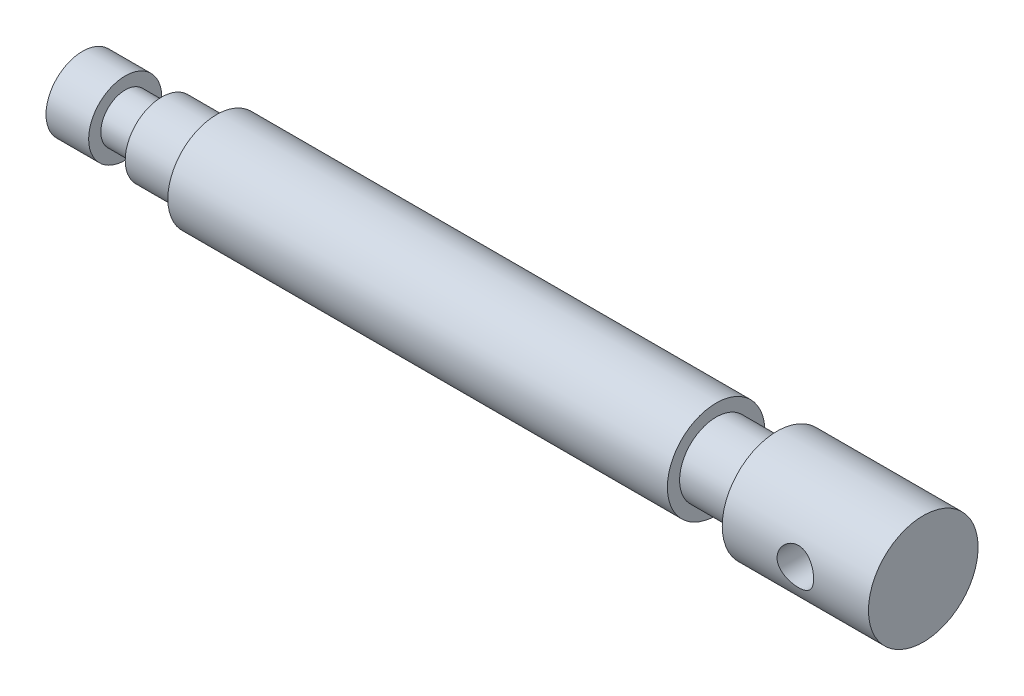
from build123d import *

# Parameters (mm, degrees)
CUT_EXTRUDE1_DEPTH      = 139.585713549
CUT_EXTRUDE1_DEPTH_BACK = 139.585713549
SKETCH2_R               = 3


with BuildPart() as part:
    # Sketch1 → Revolve1 (revolve)
    with BuildSketch(Plane.XY, mode=Mode.PRIVATE) as revolve1_sk:
        Polygon((0, 0), (0, 6), (7, 6), (7, 4), (13, 4), (13, 6), (22, 6), (22, 8), (104, 8), (104, 6), (114, 6), (114, 9), (138, 9), (138, 0), align=None)
    revolve(revolve1_sk.sketch.rotate(Axis((0, 0, 0), (1, 0, 0)), 90), axis=Axis((0, 0, 0), (1, 0, 0)))

    # Sketch2 → Cut-Extrude1 (cut, two sides: drawn at the far end of the back side and taken through both)
    with BuildSketch(Plane.XY.offset(-CUT_EXTRUDE1_DEPTH_BACK)):
        with Locations((126, 0)):
            Circle(SKETCH2_R)
    extrude(amount=CUT_EXTRUDE1_DEPTH + CUT_EXTRUDE1_DEPTH_BACK, mode=Mode.SUBTRACT)


solid = part.part
